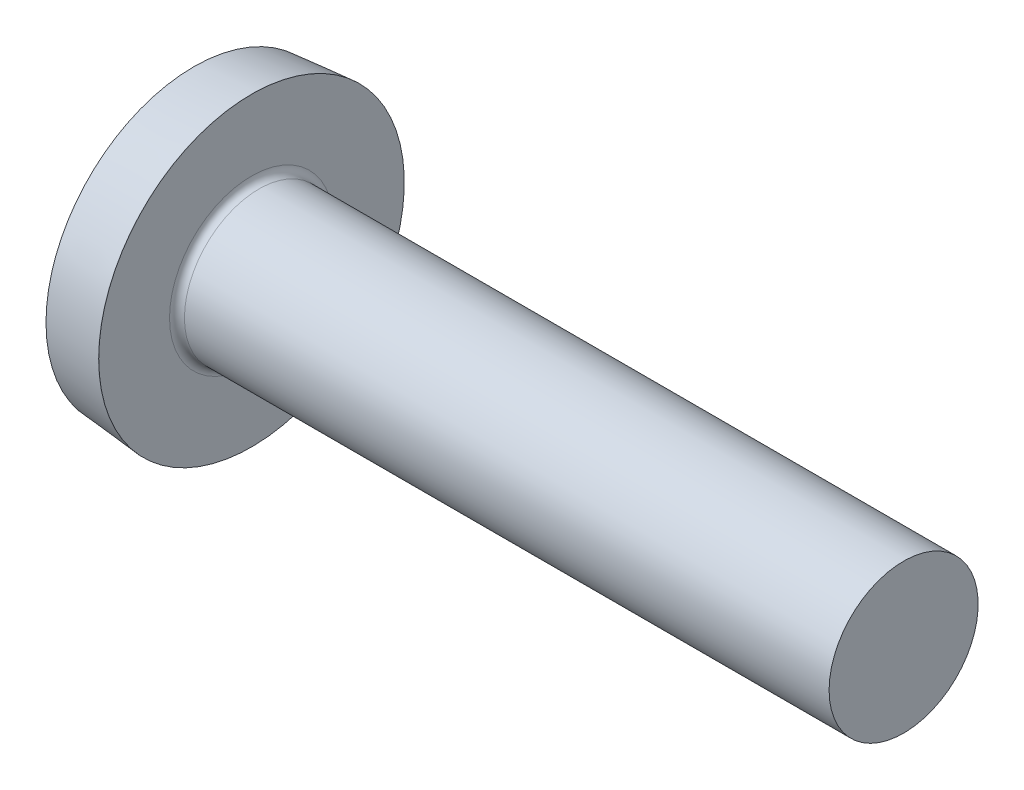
from build123d import *

# Parameters (mm, degrees)
FILLET1_R    = 0.4
RECPAT_COUNT = 2
RECPAT_ANGLE = 90


with BuildPart() as part:
    # BodySke → Base-Revolve (revolve)
    with BuildSketch(Plane.XY, mode=Mode.PRIVATE) as base_revolve_sk:
        with BuildLine():
            Line((4.8, 4), (4.8, 8.2))
            Line((4.8, 8.2), (4.79, 8.2))
            Line((4.79, 8.2), (1.7, 7.92966003))
            ThreePointArc((1.7, 7.92966003), (0.429774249, 4.054920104), (0, 0))
            Line((0, 0), (39.8, 0))
            Line((39.8, 0), (39.8, 4))
            Line((39.8, 4), (4.8, 4))
        make_face()
    revolve(base_revolve_sk.sketch.rotate(Axis((1.7, 0, 0), (1, 0, 0)), 90), axis=Axis((1.7, 0, 0), (1, 0, 0)))

    # Fillet1
    fillet1_edges = [part.edges().sort_by_distance(p)[0] for p in [
        (4.8, 0, -4),
    ]]
    fillet(fillet1_edges, radius=FILLET1_R)

    # Sketch3 → Recess section 0
    with BuildSketch(Plane(origin=(0, 0, 0), x_dir=(0, 0, -1), z_dir=(1, 0, 0))):
        with BuildLine():
            Line((0.71, -3.9), (-0.71, -3.9))
            Line((-0.71, -3.9), (-0.71, 3.9))
            Line((-0.71, 3.9), (0.71, 3.9))
            Line((0.71, 3.9), (0.71, -3.9))
        make_face()
    # Sketch4 → Recess section 1
    with BuildSketch(Plane(origin=(4.36, 0, 0), x_dir=(0, 0, -1), z_dir=(1, 0, 0))):
        with BuildLine():
            Line((0.71, -1.726184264), (-0.71, -1.726184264))
            Line((-0.71, -1.726184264), (-0.71, 1.726184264))
            Line((-0.71, 1.726184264), (0.71, 1.726184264))
            Line((0.71, 1.726184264), (0.71, -1.726184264))
        make_face()
    recess = loft(mode=Mode.SUBTRACT)

    # RecPat: Recess ×2 about axis
    recpat_axis = Axis((0, 0, 0), (1, 0, 0))
    for i in range(1, RECPAT_COUNT):
        add(recess.rotate(recpat_axis, i * RECPAT_ANGLE / (RECPAT_COUNT - 1)), mode=Mode.SUBTRACT)

    # RecCorSke → RecessCore (revolve, cut)
    with BuildSketch(Plane.XY, mode=Mode.PRIVATE) as recesscore_sk:
        Polygon((0, 0), (0, 1.5853809), (4.36, 1.2805), (4.776059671, 0), align=None)
    revolve(recesscore_sk.sketch.rotate(Axis((-3.175, 0, 0), (1, 0, 0)), 10.822716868), axis=Axis((-3.175, 0, 0), (1, 0, 0)), mode=Mode.SUBTRACT)


solid = part.part
